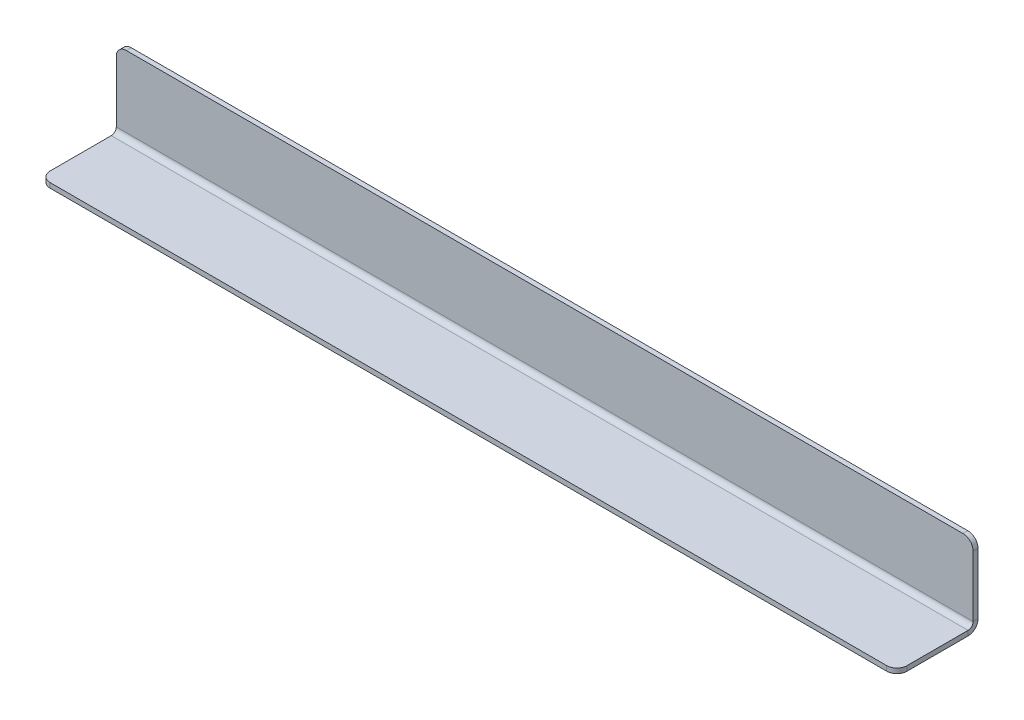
ISO-10303-21;
HEADER;
FILE_DESCRIPTION(('STEP AP214'),'2;1');
FILE_NAME('part.step','',(''),(''),'','','');
FILE_SCHEMA(('AUTOMOTIVE_DESIGN { 1 0 10303 214 1 1 1 1 }'));
ENDSEC;
DATA;
#1=APPLICATION_CONTEXT('core data for automotive mechanical design processes');
#2=APPLICATION_PROTOCOL_DEFINITION('international standard','automotive_design',2000,#1);
#3=PRODUCT_CONTEXT('',#1,'mechanical');
#4=PRODUCT('Part','Part','',(#3));
#5=PRODUCT_RELATED_PRODUCT_CATEGORY('part','',(#4));
#6=PRODUCT_DEFINITION_FORMATION('','',#4);
#7=PRODUCT_DEFINITION_CONTEXT('part definition',#1,'design');
#8=PRODUCT_DEFINITION('design','',#6,#7);
#9=PRODUCT_DEFINITION_SHAPE('','',#8);
#10=(LENGTH_UNIT() NAMED_UNIT(*) SI_UNIT(.MILLI.,.METRE.));
#11=(NAMED_UNIT(*) PLANE_ANGLE_UNIT() SI_UNIT($,.RADIAN.));
#12=(NAMED_UNIT(*) SI_UNIT($,.STERADIAN.) SOLID_ANGLE_UNIT());
#13=UNCERTAINTY_MEASURE_WITH_UNIT(LENGTH_MEASURE(1.E-05),#10,'distance_accuracy_value','');
#14=(GEOMETRIC_REPRESENTATION_CONTEXT(3) GLOBAL_UNCERTAINTY_ASSIGNED_CONTEXT((#13)) GLOBAL_UNIT_ASSIGNED_CONTEXT((#10,
#11,#12)) REPRESENTATION_CONTEXT('',''));
#15=CARTESIAN_POINT('',(0.,0.,0.));
#16=DIRECTION('',(0.,0.,1.));
#17=DIRECTION('',(1.,0.,0.));
#18=AXIS2_PLACEMENT_3D('',#15,#16,#17);
#19=CARTESIAN_POINT('',(0.,6.223,0.));
#20=DIRECTION('',(-1.,0.,0.));
#21=DIRECTION('',(0.,0.,1.));
#22=AXIS2_PLACEMENT_3D('',#19,#20,#21);
#23=PLANE('',#22);
#24=DIRECTION('',(0.,0.,1.));
#25=VECTOR('',#24,1.);
#26=CARTESIAN_POINT('',(0.,6.223,0.));
#27=LINE('',#26,#25);
#28=CARTESIAN_POINT('',(0.,6.223,0.));
#29=VERTEX_POINT('',#28);
#30=CARTESIAN_POINT('',(0.,6.223,3.048));
#31=VERTEX_POINT('',#30);
#32=EDGE_CURVE('E200',#29,#31,#27,.T.);
#33=ORIENTED_EDGE('',*,*,#32,.F.);
#34=CARTESIAN_POINT('',(0.,6.223,6.223));
#35=DIRECTION('',(1.,0.,0.));
#36=DIRECTION('',(0.,0.,-1.));
#37=AXIS2_PLACEMENT_3D('',#34,#35,#36);
#38=CIRCLE('',#37,6.223);
#39=CARTESIAN_POINT('',(0.,0.,6.223));
#40=VERTEX_POINT('',#39);
#41=EDGE_CURVE('E310',#29,#40,#38,.F.);
#42=ORIENTED_EDGE('',*,*,#41,.T.);
#43=DIRECTION('',(0.,-1.,0.));
#44=VECTOR('',#43,1.);
#45=CARTESIAN_POINT('',(0.,3.048,6.223));
#46=LINE('',#45,#44);
#47=CARTESIAN_POINT('',(0.,3.048,6.223));
#48=VERTEX_POINT('',#47);
#49=EDGE_CURVE('E197',#48,#40,#46,.T.);
#50=ORIENTED_EDGE('',*,*,#49,.F.);
#51=CARTESIAN_POINT('',(0.,6.223,6.223));
#52=DIRECTION('',(1.,0.,0.));
#53=DIRECTION('',(0.,0.,-1.));
#54=AXIS2_PLACEMENT_3D('',#51,#52,#53);
#55=CIRCLE('',#54,3.175);
#56=EDGE_CURVE('E284',#31,#48,#55,.F.);
#57=ORIENTED_EDGE('',*,*,#56,.F.);
#58=EDGE_LOOP('',(#33,#42,#50,#57));
#59=FACE_BOUND('',#58,.T.);
#60=ADVANCED_FACE('F50',(#59),#23,.T.);
#61=CARTESIAN_POINT('',(0.,3.048,6.223));
#62=DIRECTION('',(-1.,0.,0.));
#63=DIRECTION('',(0.,0.,1.));
#64=AXIS2_PLACEMENT_3D('',#61,#62,#63);
#65=PLANE('',#64);
#66=DIRECTION('',(0.,1.,0.));
#67=VECTOR('',#66,1.);
#68=CARTESIAN_POINT('',(0.,0.,3.048));
#69=LINE('',#68,#67);
#70=CARTESIAN_POINT('',(0.,44.45,3.048));
#71=VERTEX_POINT('',#70);
#72=EDGE_CURVE('E274',#71,#31,#69,.F.);
#73=ORIENTED_EDGE('',*,*,#72,.F.);
#74=DIRECTION('',(0.,0.,-1.));
#75=VECTOR('',#74,1.);
#76=CARTESIAN_POINT('',(0.,44.45,6.22300000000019));
#77=LINE('',#76,#75);
#78=CARTESIAN_POINT('',(0.,44.45,0.));
#79=VERTEX_POINT('',#78);
#80=EDGE_CURVE('E227',#71,#79,#77,.T.);
#81=ORIENTED_EDGE('',*,*,#80,.T.);
#82=DIRECTION('',(0.,-1.,0.));
#83=VECTOR('',#82,1.);
#84=CARTESIAN_POINT('',(0.,0.,0.));
#85=LINE('',#84,#83);
#86=EDGE_CURVE('E285',#79,#29,#85,.T.);
#87=ORIENTED_EDGE('',*,*,#86,.T.);
#88=ORIENTED_EDGE('',*,*,#32,.T.);
#89=EDGE_LOOP('',(#73,#81,#87,#88));
#90=FACE_BOUND('',#89,.T.);
#91=ADVANCED_FACE('F279',(#90),#65,.T.);
#92=CARTESIAN_POINT('',(608.417048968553,3.048,0.));
#93=DIRECTION('',(0.,-1.,0.));
#94=DIRECTION('',(0.,0.,-1.));
#95=AXIS2_PLACEMENT_3D('',#92,#93,#94);
#96=PLANE('',#95);
#97=DIRECTION('',(0.,0.,1.));
#98=VECTOR('',#97,1.);
#99=CARTESIAN_POINT('',(0.,3.048,0.));
#100=LINE('',#99,#98);
#101=CARTESIAN_POINT('',(0.,3.04799999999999,44.45));
#102=VERTEX_POINT('',#101);
#103=EDGE_CURVE('E315',#48,#102,#100,.T.);
#104=ORIENTED_EDGE('',*,*,#103,.T.);
#105=CARTESIAN_POINT('',(6.35,3.04799999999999,44.45));
#106=DIRECTION('',(0.,-1.,0.));
#107=DIRECTION('',(0.,0.,-1.));
#108=AXIS2_PLACEMENT_3D('',#105,#106,#107);
#109=CIRCLE('',#108,6.35);
#110=CARTESIAN_POINT('',(6.34999999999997,3.04799999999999,50.8));
#111=VERTEX_POINT('',#110);
#112=EDGE_CURVE('E211',#102,#111,#109,.F.);
#113=ORIENTED_EDGE('',*,*,#112,.T.);
#114=DIRECTION('',(-1.,0.,0.));
#115=VECTOR('',#114,1.);
#116=CARTESIAN_POINT('',(608.417048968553,3.04799999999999,50.8));
#117=LINE('',#116,#115);
#118=CARTESIAN_POINT('',(530.225,3.04799999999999,50.8));
#119=VERTEX_POINT('',#118);
#120=EDGE_CURVE('E188',#119,#111,#117,.T.);
#121=ORIENTED_EDGE('',*,*,#120,.F.);
#122=CARTESIAN_POINT('',(530.225,3.04799999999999,44.45));
#123=DIRECTION('',(0.,-1.,0.));
#124=DIRECTION('',(0.,0.,-1.));
#125=AXIS2_PLACEMENT_3D('',#122,#123,#124);
#126=CIRCLE('',#125,6.35);
#127=CARTESIAN_POINT('',(536.575,3.04799999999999,44.45));
#128=VERTEX_POINT('',#127);
#129=EDGE_CURVE('E208',#119,#128,#126,.F.);
#130=ORIENTED_EDGE('',*,*,#129,.T.);
#131=DIRECTION('',(0.,0.,-1.));
#132=VECTOR('',#131,1.);
#133=CARTESIAN_POINT('',(536.575,3.048,0.));
#134=LINE('',#133,#132);
#135=CARTESIAN_POINT('',(536.575,3.048,6.223));
#136=VERTEX_POINT('',#135);
#137=EDGE_CURVE('E155',#136,#128,#134,.F.);
#138=ORIENTED_EDGE('',*,*,#137,.F.);
#139=DIRECTION('',(-1.,0.,0.));
#140=VECTOR('',#139,1.);
#141=CARTESIAN_POINT('',(608.417048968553,3.048,6.223));
#142=LINE('',#141,#140);
#143=EDGE_CURVE('E301',#136,#48,#142,.T.);
#144=ORIENTED_EDGE('',*,*,#143,.T.);
#145=EDGE_LOOP('',(#104,#113,#121,#130,#138,#144));
#146=FACE_BOUND('',#145,.T.);
#147=ADVANCED_FACE('F366',(#146),#96,.F.);
#148=CARTESIAN_POINT('',(608.417048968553,0.,50.8));
#149=DIRECTION('',(0.,0.,1.));
#150=DIRECTION('',(1.,0.,0.));
#151=AXIS2_PLACEMENT_3D('',#148,#149,#150);
#152=PLANE('',#151);
#153=ORIENTED_EDGE('',*,*,#120,.T.);
#154=DIRECTION('',(0.,1.,0.));
#155=VECTOR('',#154,1.);
#156=CARTESIAN_POINT('',(6.35,0.,50.8));
#157=LINE('',#156,#155);
#158=CARTESIAN_POINT('',(6.34999999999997,0.,50.8));
#159=VERTEX_POINT('',#158);
#160=EDGE_CURVE('E218',#111,#159,#157,.F.);
#161=ORIENTED_EDGE('',*,*,#160,.T.);
#162=DIRECTION('',(-1.,0.,0.));
#163=VECTOR('',#162,1.);
#164=CARTESIAN_POINT('',(608.417048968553,0.,50.8));
#165=LINE('',#164,#163);
#166=CARTESIAN_POINT('',(530.225,0.,50.8));
#167=VERTEX_POINT('',#166);
#168=EDGE_CURVE('E183',#167,#159,#165,.T.);
#169=ORIENTED_EDGE('',*,*,#168,.F.);
#170=DIRECTION('',(0.,1.,0.));
#171=VECTOR('',#170,1.);
#172=CARTESIAN_POINT('',(530.225,0.,50.8));
#173=LINE('',#172,#171);
#174=EDGE_CURVE('E214',#167,#119,#173,.T.);
#175=ORIENTED_EDGE('',*,*,#174,.T.);
#176=EDGE_LOOP('',(#153,#161,#169,#175));
#177=FACE_BOUND('',#176,.T.);
#178=ADVANCED_FACE('F355',(#177),#152,.T.);
#179=CARTESIAN_POINT('',(608.417048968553,0.,0.));
#180=DIRECTION('',(0.,-1.,0.));
#181=DIRECTION('',(0.,0.,-1.));
#182=AXIS2_PLACEMENT_3D('',#179,#180,#181);
#183=PLANE('',#182);
#184=ORIENTED_EDGE('',*,*,#168,.T.);
#185=CARTESIAN_POINT('',(6.35,0.,44.45));
#186=DIRECTION('',(0.,-1.,0.));
#187=DIRECTION('',(0.,0.,-1.));
#188=AXIS2_PLACEMENT_3D('',#185,#186,#187);
#189=CIRCLE('',#188,6.35);
#190=CARTESIAN_POINT('',(0.,0.,44.45));
#191=VERTEX_POINT('',#190);
#192=EDGE_CURVE('E224',#159,#191,#189,.T.);
#193=ORIENTED_EDGE('',*,*,#192,.T.);
#194=DIRECTION('',(0.,0.,1.));
#195=VECTOR('',#194,1.);
#196=CARTESIAN_POINT('',(0.,0.,0.));
#197=LINE('',#196,#195);
#198=EDGE_CURVE('E180',#40,#191,#197,.T.);
#199=ORIENTED_EDGE('',*,*,#198,.F.);
#200=DIRECTION('',(-1.,0.,0.));
#201=VECTOR('',#200,1.);
#202=CARTESIAN_POINT('',(608.417048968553,0.,6.223));
#203=LINE('',#202,#201);
#204=CARTESIAN_POINT('',(536.575,0.,6.223));
#205=VERTEX_POINT('',#204);
#206=EDGE_CURVE('E171',#205,#40,#203,.T.);
#207=ORIENTED_EDGE('',*,*,#206,.F.);
#208=DIRECTION('',(0.,0.,1.));
#209=VECTOR('',#208,1.);
#210=CARTESIAN_POINT('',(536.575,0.,0.));
#211=LINE('',#210,#209);
#212=CARTESIAN_POINT('',(536.575,0.,44.45));
#213=VERTEX_POINT('',#212);
#214=EDGE_CURVE('E158',#205,#213,#211,.T.);
#215=ORIENTED_EDGE('',*,*,#214,.T.);
#216=CARTESIAN_POINT('',(530.225,0.,44.45));
#217=DIRECTION('',(0.,-1.,0.));
#218=DIRECTION('',(0.,0.,-1.));
#219=AXIS2_PLACEMENT_3D('',#216,#217,#218);
#220=CIRCLE('',#219,6.35);
#221=EDGE_CURVE('E221',#213,#167,#220,.T.);
#222=ORIENTED_EDGE('',*,*,#221,.T.);
#223=EDGE_LOOP('',(#184,#193,#199,#207,#215,#222));
#224=FACE_BOUND('',#223,.T.);
#225=ADVANCED_FACE('F178',(#224),#183,.T.);
#226=CARTESIAN_POINT('',(608.417048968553,6.223,6.223));
#227=DIRECTION('',(-1.,0.,0.));
#228=DIRECTION('',(0.,0.,1.));
#229=AXIS2_PLACEMENT_3D('',#226,#227,#228);
#230=CYLINDRICAL_SURFACE('',#229,6.223);
#231=DIRECTION('',(-1.,0.,0.));
#232=VECTOR('',#231,1.);
#233=CARTESIAN_POINT('',(608.417048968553,6.223,0.));
#234=LINE('',#233,#232);
#235=CARTESIAN_POINT('',(536.575,6.223,0.));
#236=VERTEX_POINT('',#235);
#237=EDGE_CURVE('E174',#236,#29,#234,.T.);
#238=ORIENTED_EDGE('',*,*,#237,.F.);
#239=CARTESIAN_POINT('',(536.575,6.223,6.223));
#240=DIRECTION('',(-1.,0.,0.));
#241=DIRECTION('',(0.,0.,1.));
#242=AXIS2_PLACEMENT_3D('',#239,#240,#241);
#243=CIRCLE('',#242,6.223);
#244=EDGE_CURVE('E146',#205,#236,#243,.F.);
#245=ORIENTED_EDGE('',*,*,#244,.F.);
#246=ORIENTED_EDGE('',*,*,#206,.T.);
#247=ORIENTED_EDGE('',*,*,#41,.F.);
#248=EDGE_LOOP('',(#238,#245,#246,#247));
#249=FACE_BOUND('',#248,.T.);
#250=ADVANCED_FACE('F169',(#249),#230,.T.);
#251=CARTESIAN_POINT('',(608.417048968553,0.,0.));
#252=DIRECTION('',(0.,0.,-1.));
#253=DIRECTION('',(-1.,0.,0.));
#254=AXIS2_PLACEMENT_3D('',#251,#252,#253);
#255=PLANE('',#254);
#256=ORIENTED_EDGE('',*,*,#86,.F.);
#257=CARTESIAN_POINT('',(6.35,44.45,0.));
#258=DIRECTION('',(0.,0.,-1.));
#259=DIRECTION('',(-1.,0.,0.));
#260=AXIS2_PLACEMENT_3D('',#257,#258,#259);
#261=CIRCLE('',#260,6.35);
#262=CARTESIAN_POINT('',(6.34999999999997,50.8,0.));
#263=VERTEX_POINT('',#262);
#264=EDGE_CURVE('E234',#79,#263,#261,.T.);
#265=ORIENTED_EDGE('',*,*,#264,.T.);
#266=DIRECTION('',(-1.,0.,0.));
#267=VECTOR('',#266,1.);
#268=CARTESIAN_POINT('',(608.417048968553,50.8,0.));
#269=LINE('',#268,#267);
#270=CARTESIAN_POINT('',(530.225,50.8,0.));
#271=VERTEX_POINT('',#270);
#272=EDGE_CURVE('E190',#271,#263,#269,.T.);
#273=ORIENTED_EDGE('',*,*,#272,.F.);
#274=CARTESIAN_POINT('',(530.225,44.45,0.));
#275=DIRECTION('',(0.,0.,-1.));
#276=DIRECTION('',(-1.,0.,0.));
#277=AXIS2_PLACEMENT_3D('',#274,#275,#276);
#278=CIRCLE('',#277,6.35);
#279=CARTESIAN_POINT('',(536.575,44.45,0.));
#280=VERTEX_POINT('',#279);
#281=EDGE_CURVE('E231',#271,#280,#278,.T.);
#282=ORIENTED_EDGE('',*,*,#281,.T.);
#283=DIRECTION('',(0.,1.,0.));
#284=VECTOR('',#283,1.);
#285=CARTESIAN_POINT('',(536.575,0.,0.));
#286=LINE('',#285,#284);
#287=EDGE_CURVE('E322',#280,#236,#286,.F.);
#288=ORIENTED_EDGE('',*,*,#287,.T.);
#289=ORIENTED_EDGE('',*,*,#237,.T.);
#290=EDGE_LOOP('',(#256,#265,#273,#282,#288,#289));
#291=FACE_BOUND('',#290,.T.);
#292=ADVANCED_FACE('F290',(#291),#255,.T.);
#293=CARTESIAN_POINT('',(608.417048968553,50.8,3.048));
#294=DIRECTION('',(0.,1.,0.));
#295=DIRECTION('',(0.,0.,1.));
#296=AXIS2_PLACEMENT_3D('',#293,#294,#295);
#297=PLANE('',#296);
#298=ORIENTED_EDGE('',*,*,#272,.T.);
#299=DIRECTION('',(0.,0.,-1.));
#300=VECTOR('',#299,1.);
#301=CARTESIAN_POINT('',(6.34999999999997,50.8,3.048));
#302=LINE('',#301,#300);
#303=CARTESIAN_POINT('',(6.34999999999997,50.8,3.048));
#304=VERTEX_POINT('',#303);
#305=EDGE_CURVE('E72',#263,#304,#302,.F.);
#306=ORIENTED_EDGE('',*,*,#305,.T.);
#307=DIRECTION('',(-1.,0.,0.));
#308=VECTOR('',#307,1.);
#309=CARTESIAN_POINT('',(608.417048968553,50.8,3.048));
#310=LINE('',#309,#308);
#311=CARTESIAN_POINT('',(530.225,50.8,3.048));
#312=VERTEX_POINT('',#311);
#313=EDGE_CURVE('E275',#312,#304,#310,.T.);
#314=ORIENTED_EDGE('',*,*,#313,.F.);
#315=DIRECTION('',(0.,0.,-1.));
#316=VECTOR('',#315,1.);
#317=CARTESIAN_POINT('',(530.225,50.8,3.048));
#318=LINE('',#317,#316);
#319=EDGE_CURVE('E237',#312,#271,#318,.T.);
#320=ORIENTED_EDGE('',*,*,#319,.T.);
#321=EDGE_LOOP('',(#298,#306,#314,#320));
#322=FACE_BOUND('',#321,.T.);
#323=ADVANCED_FACE('F291',(#322),#297,.T.);
#324=CARTESIAN_POINT('',(608.417048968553,0.,3.048));
#325=DIRECTION('',(0.,0.,-1.));
#326=DIRECTION('',(-1.,0.,0.));
#327=AXIS2_PLACEMENT_3D('',#324,#325,#326);
#328=PLANE('',#327);
#329=ORIENTED_EDGE('',*,*,#313,.T.);
#330=CARTESIAN_POINT('',(6.35,44.45,3.048));
#331=DIRECTION('',(0.,0.,-1.));
#332=DIRECTION('',(-1.,0.,0.));
#333=AXIS2_PLACEMENT_3D('',#330,#331,#332);
#334=CIRCLE('',#333,6.35);
#335=EDGE_CURVE('E246',#304,#71,#334,.F.);
#336=ORIENTED_EDGE('',*,*,#335,.T.);
#337=ORIENTED_EDGE('',*,*,#72,.T.);
#338=DIRECTION('',(-1.,0.,0.));
#339=VECTOR('',#338,1.);
#340=CARTESIAN_POINT('',(608.417048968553,6.223,3.048));
#341=LINE('',#340,#339);
#342=CARTESIAN_POINT('',(536.575,6.223,3.048));
#343=VERTEX_POINT('',#342);
#344=EDGE_CURVE('E296',#343,#31,#341,.T.);
#345=ORIENTED_EDGE('',*,*,#344,.F.);
#346=DIRECTION('',(0.,-1.,0.));
#347=VECTOR('',#346,1.);
#348=CARTESIAN_POINT('',(536.575,0.,3.048));
#349=LINE('',#348,#347);
#350=CARTESIAN_POINT('',(536.575,44.45,3.048));
#351=VERTEX_POINT('',#350);
#352=EDGE_CURVE('E154',#351,#343,#349,.T.);
#353=ORIENTED_EDGE('',*,*,#352,.F.);
#354=CARTESIAN_POINT('',(530.225,44.45,3.048));
#355=DIRECTION('',(0.,0.,-1.));
#356=DIRECTION('',(-1.,0.,0.));
#357=AXIS2_PLACEMENT_3D('',#354,#355,#356);
#358=CIRCLE('',#357,6.35);
#359=EDGE_CURVE('E243',#351,#312,#358,.F.);
#360=ORIENTED_EDGE('',*,*,#359,.T.);
#361=EDGE_LOOP('',(#329,#336,#337,#345,#353,#360));
#362=FACE_BOUND('',#361,.T.);
#363=ADVANCED_FACE('F272',(#362),#328,.F.);
#364=CARTESIAN_POINT('',(608.417048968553,6.223,6.223));
#365=DIRECTION('',(-1.,0.,0.));
#366=DIRECTION('',(0.,0.,1.));
#367=AXIS2_PLACEMENT_3D('',#364,#365,#366);
#368=CYLINDRICAL_SURFACE('',#367,3.175);
#369=CARTESIAN_POINT('',(536.575,6.223,6.223));
#370=DIRECTION('',(1.,0.,0.));
#371=DIRECTION('',(0.,0.,-1.));
#372=AXIS2_PLACEMENT_3D('',#369,#370,#371);
#373=CIRCLE('',#372,3.175);
#374=EDGE_CURVE('E149',#343,#136,#373,.F.);
#375=ORIENTED_EDGE('',*,*,#374,.F.);
#376=ORIENTED_EDGE('',*,*,#344,.T.);
#377=ORIENTED_EDGE('',*,*,#56,.T.);
#378=ORIENTED_EDGE('',*,*,#143,.F.);
#379=EDGE_LOOP('',(#375,#376,#377,#378));
#380=FACE_BOUND('',#379,.T.);
#381=ADVANCED_FACE('F368',(#380),#368,.F.);
#382=CARTESIAN_POINT('',(0.,6.223,6.223));
#383=DIRECTION('',(1.,0.,0.));
#384=DIRECTION('',(0.,0.,-1.));
#385=AXIS2_PLACEMENT_3D('',#382,#383,#384);
#386=PLANE('',#385);
#387=ORIENTED_EDGE('',*,*,#198,.T.);
#388=DIRECTION('',(0.,1.,0.));
#389=VECTOR('',#388,1.);
#390=CARTESIAN_POINT('',(0.,3.04799999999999,44.45));
#391=LINE('',#390,#389);
#392=EDGE_CURVE('E204',#191,#102,#391,.T.);
#393=ORIENTED_EDGE('',*,*,#392,.T.);
#394=ORIENTED_EDGE('',*,*,#103,.F.);
#395=ORIENTED_EDGE('',*,*,#49,.T.);
#396=EDGE_LOOP('',(#387,#393,#394,#395));
#397=FACE_BOUND('',#396,.T.);
#398=ADVANCED_FACE('F362',(#397),#386,.F.);
#399=CARTESIAN_POINT('',(536.575,0.,3.048));
#400=DIRECTION('',(1.,0.,0.));
#401=DIRECTION('',(0.,-1.,0.));
#402=AXIS2_PLACEMENT_3D('',#399,#400,#401);
#403=PLANE('',#402);
#404=ORIENTED_EDGE('',*,*,#287,.F.);
#405=DIRECTION('',(0.,0.,-1.));
#406=VECTOR('',#405,1.);
#407=CARTESIAN_POINT('',(536.575,44.45,3.0480000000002));
#408=LINE('',#407,#406);
#409=EDGE_CURVE('E11',#280,#351,#408,.F.);
#410=ORIENTED_EDGE('',*,*,#409,.T.);
#411=ORIENTED_EDGE('',*,*,#352,.T.);
#412=DIRECTION('',(0.,0.,1.));
#413=VECTOR('',#412,1.);
#414=CARTESIAN_POINT('',(536.575,6.223,3.048));
#415=LINE('',#414,#413);
#416=EDGE_CURVE('E319',#343,#236,#415,.F.);
#417=ORIENTED_EDGE('',*,*,#416,.T.);
#418=EDGE_LOOP('',(#404,#410,#411,#417));
#419=FACE_BOUND('',#418,.T.);
#420=ADVANCED_FACE('F371',(#419),#403,.T.);
#421=CARTESIAN_POINT('',(536.575,0.,0.));
#422=DIRECTION('',(1.,0.,0.));
#423=DIRECTION('',(0.,0.,1.));
#424=AXIS2_PLACEMENT_3D('',#421,#422,#423);
#425=PLANE('',#424);
#426=ORIENTED_EDGE('',*,*,#137,.T.);
#427=DIRECTION('',(0.,1.,0.));
#428=VECTOR('',#427,1.);
#429=CARTESIAN_POINT('',(536.575,0.,44.45));
#430=LINE('',#429,#428);
#431=EDGE_CURVE('E59',#128,#213,#430,.F.);
#432=ORIENTED_EDGE('',*,*,#431,.T.);
#433=ORIENTED_EDGE('',*,*,#214,.F.);
#434=DIRECTION('',(0.,-1.,0.));
#435=VECTOR('',#434,1.);
#436=CARTESIAN_POINT('',(536.575,0.,6.223));
#437=LINE('',#436,#435);
#438=EDGE_CURVE('E141',#205,#136,#437,.F.);
#439=ORIENTED_EDGE('',*,*,#438,.T.);
#440=EDGE_LOOP('',(#426,#432,#433,#439));
#441=FACE_BOUND('',#440,.T.);
#442=ADVANCED_FACE('F159',(#441),#425,.T.);
#443=CARTESIAN_POINT('',(536.575,6.223,6.223));
#444=DIRECTION('',(-1.,0.,0.));
#445=DIRECTION('',(0.,0.,1.));
#446=AXIS2_PLACEMENT_3D('',#443,#444,#445);
#447=PLANE('',#446);
#448=ORIENTED_EDGE('',*,*,#244,.T.);
#449=ORIENTED_EDGE('',*,*,#416,.F.);
#450=ORIENTED_EDGE('',*,*,#374,.T.);
#451=ORIENTED_EDGE('',*,*,#438,.F.);
#452=EDGE_LOOP('',(#448,#449,#450,#451));
#453=FACE_BOUND('',#452,.T.);
#454=ADVANCED_FACE('F143',(#453),#447,.F.);
#455=CARTESIAN_POINT('',(6.35,6.223,44.45));
#456=DIRECTION('',(0.,-1.,0.));
#457=DIRECTION('',(0.,0.,-1.));
#458=AXIS2_PLACEMENT_3D('',#455,#456,#457);
#459=CYLINDRICAL_SURFACE('',#458,6.35);
#460=ORIENTED_EDGE('',*,*,#192,.F.);
#461=ORIENTED_EDGE('',*,*,#160,.F.);
#462=ORIENTED_EDGE('',*,*,#112,.F.);
#463=ORIENTED_EDGE('',*,*,#392,.F.);
#464=EDGE_LOOP('',(#460,#461,#462,#463));
#465=FACE_BOUND('',#464,.T.);
#466=ADVANCED_FACE('F359',(#465),#459,.T.);
#467=CARTESIAN_POINT('',(6.35,44.45,6.22300000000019));
#468=DIRECTION('',(0.,0.,-1.));
#469=DIRECTION('',(0.,1.,0.));
#470=AXIS2_PLACEMENT_3D('',#467,#468,#469);
#471=CYLINDRICAL_SURFACE('',#470,6.35);
#472=ORIENTED_EDGE('',*,*,#335,.F.);
#473=ORIENTED_EDGE('',*,*,#305,.F.);
#474=ORIENTED_EDGE('',*,*,#264,.F.);
#475=ORIENTED_EDGE('',*,*,#80,.F.);
#476=EDGE_LOOP('',(#472,#473,#474,#475));
#477=FACE_BOUND('',#476,.T.);
#478=ADVANCED_FACE('F287',(#477),#471,.T.);
#479=CARTESIAN_POINT('',(530.225,0.,44.45));
#480=DIRECTION('',(0.,1.,0.));
#481=DIRECTION('',(0.,0.,1.));
#482=AXIS2_PLACEMENT_3D('',#479,#480,#481);
#483=CYLINDRICAL_SURFACE('',#482,6.35);
#484=ORIENTED_EDGE('',*,*,#221,.F.);
#485=ORIENTED_EDGE('',*,*,#431,.F.);
#486=ORIENTED_EDGE('',*,*,#129,.F.);
#487=ORIENTED_EDGE('',*,*,#174,.F.);
#488=EDGE_LOOP('',(#484,#485,#486,#487));
#489=FACE_BOUND('',#488,.T.);
#490=ADVANCED_FACE('F350',(#489),#483,.T.);
#491=CARTESIAN_POINT('',(530.225,44.45,3.04799999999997));
#492=DIRECTION('',(0.,0.,-1.));
#493=DIRECTION('',(0.,1.,0.));
#494=AXIS2_PLACEMENT_3D('',#491,#492,#493);
#495=CYLINDRICAL_SURFACE('',#494,6.35);
#496=ORIENTED_EDGE('',*,*,#359,.F.);
#497=ORIENTED_EDGE('',*,*,#409,.F.);
#498=ORIENTED_EDGE('',*,*,#281,.F.);
#499=ORIENTED_EDGE('',*,*,#319,.F.);
#500=EDGE_LOOP('',(#496,#497,#498,#499));
#501=FACE_BOUND('',#500,.T.);
#502=ADVANCED_FACE('F52',(#501),#495,.T.);
#503=CLOSED_SHELL('',(#60,#91,#147,#178,#225,#250,#292,#323,#363,#381,#398,#420,#442,#454,#466,
#478,#490,#502));
#504=MANIFOLD_SOLID_BREP('B2',#503);
#505=ADVANCED_BREP_SHAPE_REPRESENTATION('',(#18,#504),#14);
#506=SHAPE_DEFINITION_REPRESENTATION(#9,#505);
ENDSEC;
END-ISO-10303-21;
